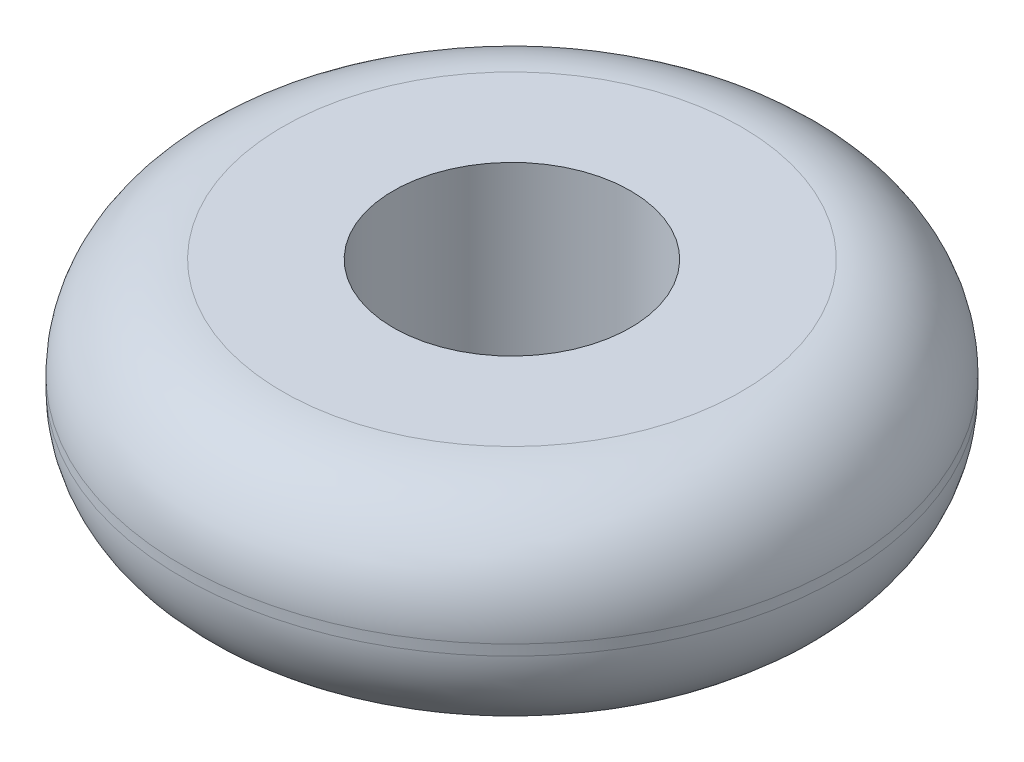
from build123d import *


with BuildPart() as part:
    # Esquisse1 → R_volution1 (revolve)
    with BuildSketch(Plane.XY, mode=Mode.PRIVATE) as r_volution1_sk:
        with BuildLine():
            Line((-12.5, 3.8), (-12.5, 4.2))
            ThreePointArc((-12.5, 4.2), (-11.387005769, 6.887005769), (-8.7, 8))
            Line((-8.7, 8), (-4.5, 8))
            Line((-4.5, 8), (-4.5, 0))
            Line((-4.5, 0), (-8.7, 0))
            ThreePointArc((-8.7, 0), (-11.387005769, 1.112994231), (-12.5, 3.8))
        make_face()
    revolve(r_volution1_sk.sketch.rotate(Axis((0, 0, 0), (0, 1, 0)), 270), axis=Axis((0, 0, 0), (0, 1, 0)))


solid = part.part
